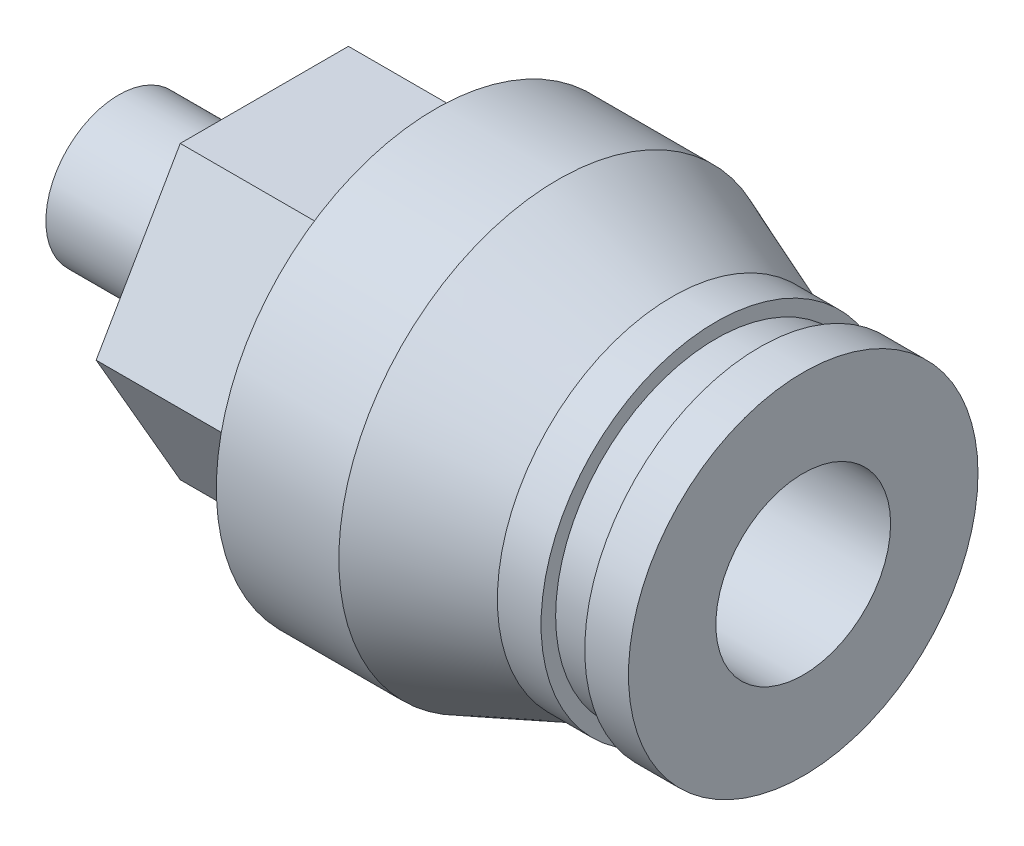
ISO-10303-21;
HEADER;
FILE_DESCRIPTION(('STEP AP214'),'2;1');
FILE_NAME('part.step','',(''),(''),'','','');
FILE_SCHEMA(('AUTOMOTIVE_DESIGN { 1 0 10303 214 1 1 1 1 }'));
ENDSEC;
DATA;
#1=APPLICATION_CONTEXT('core data for automotive mechanical design processes');
#2=APPLICATION_PROTOCOL_DEFINITION('international standard','automotive_design',2000,#1);
#3=PRODUCT_CONTEXT('',#1,'mechanical');
#4=PRODUCT('Part','Part','',(#3));
#5=PRODUCT_RELATED_PRODUCT_CATEGORY('part','',(#4));
#6=PRODUCT_DEFINITION_FORMATION('','',#4);
#7=PRODUCT_DEFINITION_CONTEXT('part definition',#1,'design');
#8=PRODUCT_DEFINITION('design','',#6,#7);
#9=PRODUCT_DEFINITION_SHAPE('','',#8);
#10=(LENGTH_UNIT() NAMED_UNIT(*) SI_UNIT(.MILLI.,.METRE.));
#11=(NAMED_UNIT(*) PLANE_ANGLE_UNIT() SI_UNIT($,.RADIAN.));
#12=(NAMED_UNIT(*) SI_UNIT($,.STERADIAN.) SOLID_ANGLE_UNIT());
#13=UNCERTAINTY_MEASURE_WITH_UNIT(LENGTH_MEASURE(1.E-05),#10,'distance_accuracy_value','');
#14=(GEOMETRIC_REPRESENTATION_CONTEXT(3) GLOBAL_UNCERTAINTY_ASSIGNED_CONTEXT((#13)) GLOBAL_UNIT_ASSIGNED_CONTEXT((#10,
#11,#12)) REPRESENTATION_CONTEXT('',''));
#15=CARTESIAN_POINT('',(0.,0.,0.));
#16=DIRECTION('',(0.,0.,1.));
#17=DIRECTION('',(1.,0.,0.));
#18=AXIS2_PLACEMENT_3D('',#15,#16,#17);
#19=CARTESIAN_POINT('',(5.,2.5,0.));
#20=DIRECTION('',(-1.,0.,0.));
#21=DIRECTION('',(0.,0.,1.));
#22=AXIS2_PLACEMENT_3D('',#19,#20,#21);
#23=PLANE('',#22);
#24=CARTESIAN_POINT('',(5.,0.,0.));
#25=DIRECTION('',(1.,0.,0.));
#26=DIRECTION('',(0.,0.,-1.));
#27=AXIS2_PLACEMENT_3D('',#24,#25,#26);
#28=CIRCLE('',#27,2.5);
#29=CARTESIAN_POINT('',(5.,0.,-2.5));
#30=VERTEX_POINT('',#29);
#31=EDGE_CURVE('E218',#30,#30,#28,.T.);
#32=ORIENTED_EDGE('',*,*,#31,.T.);
#33=EDGE_LOOP('',(#32));
#34=FACE_BOUND('',#33,.T.);
#35=DIRECTION('',(0.,-0.866025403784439,0.5));
#36=VECTOR('',#35,1.);
#37=CARTESIAN_POINT('',(5.,0.,-5.77350269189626));
#38=LINE('',#37,#36);
#39=CARTESIAN_POINT('',(5.,0.,-5.77350269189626));
#40=VERTEX_POINT('',#39);
#41=CARTESIAN_POINT('',(5.,-5.,-2.88675134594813));
#42=VERTEX_POINT('',#41);
#43=EDGE_CURVE('E127',#40,#42,#38,.T.);
#44=ORIENTED_EDGE('',*,*,#43,.T.);
#45=DIRECTION('',(0.,0.,1.));
#46=VECTOR('',#45,1.);
#47=CARTESIAN_POINT('',(5.,-5.,-2.88675134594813));
#48=LINE('',#47,#46);
#49=CARTESIAN_POINT('',(5.,-5.,2.88675134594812));
#50=VERTEX_POINT('',#49);
#51=EDGE_CURVE('E110',#42,#50,#48,.T.);
#52=ORIENTED_EDGE('',*,*,#51,.T.);
#53=DIRECTION('',(0.,0.866025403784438,0.5));
#54=VECTOR('',#53,1.);
#55=CARTESIAN_POINT('',(5.,-5.,2.88675134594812));
#56=LINE('',#55,#54);
#57=CARTESIAN_POINT('',(5.,0.,5.77350269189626));
#58=VERTEX_POINT('',#57);
#59=EDGE_CURVE('E121',#50,#58,#56,.T.);
#60=ORIENTED_EDGE('',*,*,#59,.T.);
#61=DIRECTION('',(0.,0.866025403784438,-0.5));
#62=VECTOR('',#61,1.);
#63=CARTESIAN_POINT('',(5.,0.,5.77350269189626));
#64=LINE('',#63,#62);
#65=CARTESIAN_POINT('',(5.,5.,2.88675134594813));
#66=VERTEX_POINT('',#65);
#67=EDGE_CURVE('E30',#58,#66,#64,.T.);
#68=ORIENTED_EDGE('',*,*,#67,.T.);
#69=DIRECTION('',(0.,0.,-1.));
#70=VECTOR('',#69,1.);
#71=CARTESIAN_POINT('',(5.,5.,2.88675134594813));
#72=LINE('',#71,#70);
#73=CARTESIAN_POINT('',(5.,5.,-2.88675134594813));
#74=VERTEX_POINT('',#73);
#75=EDGE_CURVE('E131',#66,#74,#72,.T.);
#76=ORIENTED_EDGE('',*,*,#75,.T.);
#77=DIRECTION('',(0.,-0.866025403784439,-0.5));
#78=VECTOR('',#77,1.);
#79=CARTESIAN_POINT('',(5.,5.,-2.88675134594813));
#80=LINE('',#79,#78);
#81=EDGE_CURVE('E134',#74,#40,#80,.T.);
#82=ORIENTED_EDGE('',*,*,#81,.T.);
#83=EDGE_LOOP('',(#44,#52,#60,#68,#76,#82));
#84=FACE_BOUND('',#83,.T.);
#85=ADVANCED_FACE('F15',(#34,#84),#23,.T.);
#86=CARTESIAN_POINT('',(0.,0.,0.));
#87=DIRECTION('',(-1.,0.,0.));
#88=DIRECTION('',(0.,0.,1.));
#89=AXIS2_PLACEMENT_3D('',#86,#87,#88);
#90=PLANE('',#89);
#91=CARTESIAN_POINT('',(0.,0.,0.));
#92=DIRECTION('',(1.,0.,0.));
#93=DIRECTION('',(0.,0.,-1.));
#94=AXIS2_PLACEMENT_3D('',#91,#92,#93);
#95=CIRCLE('',#94,2.5);
#96=CARTESIAN_POINT('',(0.,0.,-2.5));
#97=VERTEX_POINT('',#96);
#98=EDGE_CURVE('E221',#97,#97,#95,.T.);
#99=ORIENTED_EDGE('',*,*,#98,.F.);
#100=EDGE_LOOP('',(#99));
#101=FACE_BOUND('',#100,.T.);
#102=DIRECTION('',(0.,-0.866025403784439,-0.5));
#103=VECTOR('',#102,1.);
#104=CARTESIAN_POINT('',(0.,0.,1.15470053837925));
#105=LINE('',#104,#103);
#106=CARTESIAN_POINT('',(0.,0.,1.15470053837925));
#107=VERTEX_POINT('',#106);
#108=CARTESIAN_POINT('',(0.,-1.,0.577350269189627));
#109=VERTEX_POINT('',#108);
#110=EDGE_CURVE('E173',#107,#109,#105,.T.);
#111=ORIENTED_EDGE('',*,*,#110,.T.);
#112=DIRECTION('',(0.,0.,-1.));
#113=VECTOR('',#112,1.);
#114=CARTESIAN_POINT('',(0.,-1.,0.577350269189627));
#115=LINE('',#114,#113);
#116=CARTESIAN_POINT('',(0.,-1.,-0.577350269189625));
#117=VERTEX_POINT('',#116);
#118=EDGE_CURVE('E38',#109,#117,#115,.T.);
#119=ORIENTED_EDGE('',*,*,#118,.T.);
#120=DIRECTION('',(0.,0.866025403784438,-0.5));
#121=VECTOR('',#120,1.);
#122=CARTESIAN_POINT('',(0.,-1.,-0.577350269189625));
#123=LINE('',#122,#121);
#124=CARTESIAN_POINT('',(0.,0.,-1.15470053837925));
#125=VERTEX_POINT('',#124);
#126=EDGE_CURVE('E161',#117,#125,#123,.T.);
#127=ORIENTED_EDGE('',*,*,#126,.T.);
#128=DIRECTION('',(0.,0.866025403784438,0.5));
#129=VECTOR('',#128,1.);
#130=CARTESIAN_POINT('',(0.,0.,-1.15470053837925));
#131=LINE('',#130,#129);
#132=CARTESIAN_POINT('',(0.,1.,-0.577350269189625));
#133=VERTEX_POINT('',#132);
#134=EDGE_CURVE('E164',#125,#133,#131,.T.);
#135=ORIENTED_EDGE('',*,*,#134,.T.);
#136=DIRECTION('',(0.,0.,1.));
#137=VECTOR('',#136,1.);
#138=CARTESIAN_POINT('',(0.,1.,-0.577350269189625));
#139=LINE('',#138,#137);
#140=CARTESIAN_POINT('',(0.,1.,0.577350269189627));
#141=VERTEX_POINT('',#140);
#142=EDGE_CURVE('E167',#133,#141,#139,.T.);
#143=ORIENTED_EDGE('',*,*,#142,.T.);
#144=DIRECTION('',(0.,-0.866025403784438,0.5));
#145=VECTOR('',#144,1.);
#146=CARTESIAN_POINT('',(0.,1.,0.577350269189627));
#147=LINE('',#146,#145);
#148=EDGE_CURVE('E170',#141,#107,#147,.T.);
#149=ORIENTED_EDGE('',*,*,#148,.T.);
#150=EDGE_LOOP('',(#111,#119,#127,#135,#143,#149));
#151=FACE_BOUND('',#150,.T.);
#152=ADVANCED_FACE('F17',(#101,#151),#90,.T.);
#153=CARTESIAN_POINT('',(7.,3.,0.));
#154=DIRECTION('',(1.,0.,0.));
#155=DIRECTION('',(0.,0.,-1.));
#156=AXIS2_PLACEMENT_3D('',#153,#154,#155);
#157=PLANE('',#156);
#158=CARTESIAN_POINT('',(7.,0.,0.));
#159=DIRECTION('',(1.,0.,0.));
#160=DIRECTION('',(0.,0.,-1.));
#161=AXIS2_PLACEMENT_3D('',#158,#159,#160);
#162=CIRCLE('',#161,3.);
#163=CARTESIAN_POINT('',(7.,0.,-3.));
#164=VERTEX_POINT('',#163);
#165=EDGE_CURVE('E188',#164,#164,#162,.T.);
#166=ORIENTED_EDGE('',*,*,#165,.T.);
#167=EDGE_LOOP('',(#166));
#168=FACE_BOUND('',#167,.T.);
#169=DIRECTION('',(0.,-0.866025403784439,0.5));
#170=VECTOR('',#169,1.);
#171=CARTESIAN_POINT('',(7.,1.75,-2.1650635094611));
#172=LINE('',#171,#170);
#173=CARTESIAN_POINT('',(7.,0.,-1.15470053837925));
#174=VERTEX_POINT('',#173);
#175=CARTESIAN_POINT('',(7.,-1.,-0.577350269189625));
#176=VERTEX_POINT('',#175);
#177=EDGE_CURVE('E23',#174,#176,#172,.T.);
#178=ORIENTED_EDGE('',*,*,#177,.T.);
#179=DIRECTION('',(0.,0.,1.));
#180=VECTOR('',#179,1.);
#181=CARTESIAN_POINT('',(7.,-1.,0.));
#182=LINE('',#181,#180);
#183=CARTESIAN_POINT('',(7.,-1.,0.577350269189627));
#184=VERTEX_POINT('',#183);
#185=EDGE_CURVE('E9',#176,#184,#182,.T.);
#186=ORIENTED_EDGE('',*,*,#185,.T.);
#187=DIRECTION('',(0.,0.866025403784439,0.5));
#188=VECTOR('',#187,1.);
#189=CARTESIAN_POINT('',(7.,1.75,2.1650635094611));
#190=LINE('',#189,#188);
#191=CARTESIAN_POINT('',(7.,0.,1.15470053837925));
#192=VERTEX_POINT('',#191);
#193=EDGE_CURVE('E224',#184,#192,#190,.T.);
#194=ORIENTED_EDGE('',*,*,#193,.T.);
#195=DIRECTION('',(0.,0.866025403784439,-0.5));
#196=VECTOR('',#195,1.);
#197=CARTESIAN_POINT('',(7.,2.75,-0.433012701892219));
#198=LINE('',#197,#196);
#199=CARTESIAN_POINT('',(7.,1.,0.577350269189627));
#200=VERTEX_POINT('',#199);
#201=EDGE_CURVE('E227',#192,#200,#198,.T.);
#202=ORIENTED_EDGE('',*,*,#201,.T.);
#203=DIRECTION('',(0.,0.,-1.));
#204=VECTOR('',#203,1.);
#205=CARTESIAN_POINT('',(7.,1.,0.));
#206=LINE('',#205,#204);
#207=CARTESIAN_POINT('',(7.,1.,-0.577350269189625));
#208=VERTEX_POINT('',#207);
#209=EDGE_CURVE('E230',#200,#208,#206,.T.);
#210=ORIENTED_EDGE('',*,*,#209,.T.);
#211=DIRECTION('',(0.,-0.866025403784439,-0.5));
#212=VECTOR('',#211,1.);
#213=CARTESIAN_POINT('',(7.,2.75,0.433012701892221));
#214=LINE('',#213,#212);
#215=EDGE_CURVE('E233',#208,#174,#214,.T.);
#216=ORIENTED_EDGE('',*,*,#215,.T.);
#217=EDGE_LOOP('',(#178,#186,#194,#202,#210,#216));
#218=FACE_BOUND('',#217,.T.);
#219=ADVANCED_FACE('F237',(#168,#218),#157,.T.);
#220=CARTESIAN_POINT('',(0.,0.,0.));
#221=DIRECTION('',(1.,0.,0.));
#222=DIRECTION('',(0.,0.,-1.));
#223=AXIS2_PLACEMENT_3D('',#220,#221,#222);
#224=CYLINDRICAL_SURFACE('',#223,2.5);
#225=ORIENTED_EDGE('',*,*,#98,.T.);
#226=EDGE_LOOP('',(#225));
#227=FACE_BOUND('',#226,.T.);
#228=ORIENTED_EDGE('',*,*,#31,.F.);
#229=EDGE_LOOP('',(#228));
#230=FACE_BOUND('',#229,.T.);
#231=ADVANCED_FACE('F278',(#227,#230),#224,.T.);
#232=CARTESIAN_POINT('',(10.875,7.,0.));
#233=DIRECTION('',(-1.,0.,0.));
#234=DIRECTION('',(0.,0.,1.));
#235=AXIS2_PLACEMENT_3D('',#232,#233,#234);
#236=PLANE('',#235);
#237=CARTESIAN_POINT('',(10.875,0.,0.));
#238=DIRECTION('',(1.,0.,0.));
#239=DIRECTION('',(0.,0.,-1.));
#240=AXIS2_PLACEMENT_3D('',#237,#238,#239);
#241=CIRCLE('',#240,7.52263029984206);
#242=CARTESIAN_POINT('',(10.875,0.,-7.52263029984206));
#243=VERTEX_POINT('',#242);
#244=EDGE_CURVE('E215',#243,#243,#241,.T.);
#245=ORIENTED_EDGE('',*,*,#244,.F.);
#246=EDGE_LOOP('',(#245));
#247=FACE_BOUND('',#246,.T.);
#248=DIRECTION('',(0.,-0.866025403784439,0.5));
#249=VECTOR('',#248,1.);
#250=CARTESIAN_POINT('',(10.875,0.,-5.77350269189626));
#251=LINE('',#250,#249);
#252=CARTESIAN_POINT('',(10.875,0.,-5.77350269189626));
#253=VERTEX_POINT('',#252);
#254=CARTESIAN_POINT('',(10.875,-5.,-2.88675134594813));
#255=VERTEX_POINT('',#254);
#256=EDGE_CURVE('E118',#253,#255,#251,.T.);
#257=ORIENTED_EDGE('',*,*,#256,.F.);
#258=DIRECTION('',(0.,-0.866025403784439,-0.5));
#259=VECTOR('',#258,1.);
#260=CARTESIAN_POINT('',(10.875,5.,-2.88675134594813));
#261=LINE('',#260,#259);
#262=CARTESIAN_POINT('',(10.875,5.,-2.88675134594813));
#263=VERTEX_POINT('',#262);
#264=EDGE_CURVE('E146',#263,#253,#261,.T.);
#265=ORIENTED_EDGE('',*,*,#264,.F.);
#266=DIRECTION('',(0.,0.,-1.));
#267=VECTOR('',#266,1.);
#268=CARTESIAN_POINT('',(10.875,5.,2.88675134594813));
#269=LINE('',#268,#267);
#270=CARTESIAN_POINT('',(10.875,5.,2.88675134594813));
#271=VERTEX_POINT('',#270);
#272=EDGE_CURVE('E143',#271,#263,#269,.T.);
#273=ORIENTED_EDGE('',*,*,#272,.F.);
#274=DIRECTION('',(0.,0.866025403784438,-0.5));
#275=VECTOR('',#274,1.);
#276=CARTESIAN_POINT('',(10.875,0.,5.77350269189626));
#277=LINE('',#276,#275);
#278=CARTESIAN_POINT('',(10.875,0.,5.77350269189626));
#279=VERTEX_POINT('',#278);
#280=EDGE_CURVE('E140',#279,#271,#277,.T.);
#281=ORIENTED_EDGE('',*,*,#280,.F.);
#282=DIRECTION('',(0.,0.866025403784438,0.5));
#283=VECTOR('',#282,1.);
#284=CARTESIAN_POINT('',(10.875,-5.,2.88675134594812));
#285=LINE('',#284,#283);
#286=CARTESIAN_POINT('',(10.875,-5.,2.88675134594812));
#287=VERTEX_POINT('',#286);
#288=EDGE_CURVE('E138',#287,#279,#285,.T.);
#289=ORIENTED_EDGE('',*,*,#288,.F.);
#290=DIRECTION('',(0.,0.,1.));
#291=VECTOR('',#290,1.);
#292=CARTESIAN_POINT('',(10.875,-5.,-2.88675134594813));
#293=LINE('',#292,#291);
#294=EDGE_CURVE('E113',#255,#287,#293,.T.);
#295=ORIENTED_EDGE('',*,*,#294,.F.);
#296=EDGE_LOOP('',(#257,#265,#273,#281,#289,#295));
#297=FACE_BOUND('',#296,.T.);
#298=ADVANCED_FACE('F276',(#247,#297),#236,.T.);
#299=CARTESIAN_POINT('',(0.,0.,0.));
#300=DIRECTION('',(1.,0.,0.));
#301=DIRECTION('',(0.,0.,-1.));
#302=AXIS2_PLACEMENT_3D('',#299,#300,#301);
#303=CYLINDRICAL_SURFACE('',#302,7.52263029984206);
#304=ORIENTED_EDGE('',*,*,#244,.T.);
#305=EDGE_LOOP('',(#304));
#306=FACE_BOUND('',#305,.T.);
#307=CARTESIAN_POINT('',(15.0801709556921,0.,0.));
#308=DIRECTION('',(1.,0.,0.));
#309=DIRECTION('',(0.,0.,-1.));
#310=AXIS2_PLACEMENT_3D('',#307,#308,#309);
#311=CIRCLE('',#310,7.52263029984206);
#312=CARTESIAN_POINT('',(15.0801709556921,0.,-7.52263029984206));
#313=VERTEX_POINT('',#312);
#314=EDGE_CURVE('E212',#313,#313,#311,.T.);
#315=ORIENTED_EDGE('',*,*,#314,.F.);
#316=EDGE_LOOP('',(#315));
#317=FACE_BOUND('',#316,.T.);
#318=ADVANCED_FACE('F285',(#306,#317),#303,.T.);
#319=CARTESIAN_POINT('',(19.,0.,0.));
#320=DIRECTION('',(-1.,0.,0.));
#321=DIRECTION('',(0.,0.,1.));
#322=AXIS2_PLACEMENT_3D('',#319,#320,#321);
#323=CONICAL_SURFACE('',#322,6.,0.37050394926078);
#324=ORIENTED_EDGE('',*,*,#314,.T.);
#325=EDGE_LOOP('',(#324));
#326=FACE_BOUND('',#325,.T.);
#327=CARTESIAN_POINT('',(19.,0.,0.));
#328=DIRECTION('',(1.,0.,0.));
#329=DIRECTION('',(0.,0.,-1.));
#330=AXIS2_PLACEMENT_3D('',#327,#328,#329);
#331=CIRCLE('',#330,6.);
#332=CARTESIAN_POINT('',(19.,0.,-6.));
#333=VERTEX_POINT('',#332);
#334=EDGE_CURVE('E209',#333,#333,#331,.T.);
#335=ORIENTED_EDGE('',*,*,#334,.F.);
#336=EDGE_LOOP('',(#335));
#337=FACE_BOUND('',#336,.T.);
#338=ADVANCED_FACE('F316',(#326,#337),#323,.T.);
#339=CARTESIAN_POINT('',(0.,0.,0.));
#340=DIRECTION('',(1.,0.,0.));
#341=DIRECTION('',(0.,0.,-1.));
#342=AXIS2_PLACEMENT_3D('',#339,#340,#341);
#343=CYLINDRICAL_SURFACE('',#342,6.);
#344=ORIENTED_EDGE('',*,*,#334,.T.);
#345=EDGE_LOOP('',(#344));
#346=FACE_BOUND('',#345,.T.);
#347=CARTESIAN_POINT('',(20.5,0.,0.));
#348=DIRECTION('',(1.,0.,0.));
#349=DIRECTION('',(0.,0.,-1.));
#350=AXIS2_PLACEMENT_3D('',#347,#348,#349);
#351=CIRCLE('',#350,6.);
#352=CARTESIAN_POINT('',(20.5,0.,-6.));
#353=VERTEX_POINT('',#352);
#354=EDGE_CURVE('E206',#353,#353,#351,.T.);
#355=ORIENTED_EDGE('',*,*,#354,.F.);
#356=EDGE_LOOP('',(#355));
#357=FACE_BOUND('',#356,.T.);
#358=ADVANCED_FACE('F312',(#346,#357),#343,.T.);
#359=CARTESIAN_POINT('',(20.5,6.,0.));
#360=DIRECTION('',(1.,0.,0.));
#361=DIRECTION('',(0.,0.,-1.));
#362=AXIS2_PLACEMENT_3D('',#359,#360,#361);
#363=PLANE('',#362);
#364=ORIENTED_EDGE('',*,*,#354,.T.);
#365=EDGE_LOOP('',(#364));
#366=FACE_BOUND('',#365,.T.);
#367=CARTESIAN_POINT('',(20.5,0.,0.));
#368=DIRECTION('',(1.,0.,0.));
#369=DIRECTION('',(0.,0.,-1.));
#370=AXIS2_PLACEMENT_3D('',#367,#368,#369);
#371=CIRCLE('',#370,5.5);
#372=CARTESIAN_POINT('',(20.5,0.,-5.5));
#373=VERTEX_POINT('',#372);
#374=EDGE_CURVE('E203',#373,#373,#371,.T.);
#375=ORIENTED_EDGE('',*,*,#374,.F.);
#376=EDGE_LOOP('',(#375));
#377=FACE_BOUND('',#376,.T.);
#378=ADVANCED_FACE('F308',(#366,#377),#363,.T.);
#379=CARTESIAN_POINT('',(0.,0.,0.));
#380=DIRECTION('',(1.,0.,0.));
#381=DIRECTION('',(0.,0.,-1.));
#382=AXIS2_PLACEMENT_3D('',#379,#380,#381);
#383=CYLINDRICAL_SURFACE('',#382,5.5);
#384=ORIENTED_EDGE('',*,*,#374,.T.);
#385=EDGE_LOOP('',(#384));
#386=FACE_BOUND('',#385,.T.);
#387=CARTESIAN_POINT('',(22.,0.,0.));
#388=DIRECTION('',(1.,0.,0.));
#389=DIRECTION('',(0.,0.,-1.));
#390=AXIS2_PLACEMENT_3D('',#387,#388,#389);
#391=CIRCLE('',#390,5.5);
#392=CARTESIAN_POINT('',(22.,0.,-5.5));
#393=VERTEX_POINT('',#392);
#394=EDGE_CURVE('E200',#393,#393,#391,.T.);
#395=ORIENTED_EDGE('',*,*,#394,.F.);
#396=EDGE_LOOP('',(#395));
#397=FACE_BOUND('',#396,.T.);
#398=ADVANCED_FACE('F304',(#386,#397),#383,.T.);
#399=CARTESIAN_POINT('',(22.,5.5,0.));
#400=DIRECTION('',(-1.,0.,0.));
#401=DIRECTION('',(0.,0.,1.));
#402=AXIS2_PLACEMENT_3D('',#399,#400,#401);
#403=PLANE('',#402);
#404=ORIENTED_EDGE('',*,*,#394,.T.);
#405=EDGE_LOOP('',(#404));
#406=FACE_BOUND('',#405,.T.);
#407=CARTESIAN_POINT('',(22.,0.,0.));
#408=DIRECTION('',(1.,0.,0.));
#409=DIRECTION('',(0.,0.,-1.));
#410=AXIS2_PLACEMENT_3D('',#407,#408,#409);
#411=CIRCLE('',#410,6.);
#412=CARTESIAN_POINT('',(22.,0.,-6.));
#413=VERTEX_POINT('',#412);
#414=EDGE_CURVE('E197',#413,#413,#411,.T.);
#415=ORIENTED_EDGE('',*,*,#414,.F.);
#416=EDGE_LOOP('',(#415));
#417=FACE_BOUND('',#416,.T.);
#418=ADVANCED_FACE('F300',(#406,#417),#403,.T.);
#419=CARTESIAN_POINT('',(0.,0.,0.));
#420=DIRECTION('',(1.,0.,0.));
#421=DIRECTION('',(0.,0.,-1.));
#422=AXIS2_PLACEMENT_3D('',#419,#420,#421);
#423=CYLINDRICAL_SURFACE('',#422,6.);
#424=ORIENTED_EDGE('',*,*,#414,.T.);
#425=EDGE_LOOP('',(#424));
#426=FACE_BOUND('',#425,.T.);
#427=CARTESIAN_POINT('',(23.5,0.,0.));
#428=DIRECTION('',(1.,0.,0.));
#429=DIRECTION('',(0.,0.,-1.));
#430=AXIS2_PLACEMENT_3D('',#427,#428,#429);
#431=CIRCLE('',#430,6.);
#432=CARTESIAN_POINT('',(23.5,0.,-6.));
#433=VERTEX_POINT('',#432);
#434=EDGE_CURVE('E194',#433,#433,#431,.T.);
#435=ORIENTED_EDGE('',*,*,#434,.F.);
#436=EDGE_LOOP('',(#435));
#437=FACE_BOUND('',#436,.T.);
#438=ADVANCED_FACE('F296',(#426,#437),#423,.T.);
#439=CARTESIAN_POINT('',(23.5,6.,0.));
#440=DIRECTION('',(1.,0.,0.));
#441=DIRECTION('',(0.,0.,-1.));
#442=AXIS2_PLACEMENT_3D('',#439,#440,#441);
#443=PLANE('',#442);
#444=ORIENTED_EDGE('',*,*,#434,.T.);
#445=EDGE_LOOP('',(#444));
#446=FACE_BOUND('',#445,.T.);
#447=CARTESIAN_POINT('',(23.5,0.,0.));
#448=DIRECTION('',(1.,0.,0.));
#449=DIRECTION('',(0.,0.,-1.));
#450=AXIS2_PLACEMENT_3D('',#447,#448,#449);
#451=CIRCLE('',#450,3.);
#452=CARTESIAN_POINT('',(23.5,0.,-3.));
#453=VERTEX_POINT('',#452);
#454=EDGE_CURVE('E191',#453,#453,#451,.T.);
#455=ORIENTED_EDGE('',*,*,#454,.F.);
#456=EDGE_LOOP('',(#455));
#457=FACE_BOUND('',#456,.T.);
#458=ADVANCED_FACE('F264',(#446,#457),#443,.T.);
#459=CARTESIAN_POINT('',(0.,0.,0.));
#460=DIRECTION('',(1.,0.,0.));
#461=DIRECTION('',(0.,0.,-1.));
#462=AXIS2_PLACEMENT_3D('',#459,#460,#461);
#463=CYLINDRICAL_SURFACE('',#462,3.);
#464=ORIENTED_EDGE('',*,*,#454,.T.);
#465=EDGE_LOOP('',(#464));
#466=FACE_BOUND('',#465,.T.);
#467=ORIENTED_EDGE('',*,*,#165,.F.);
#468=EDGE_LOOP('',(#467));
#469=FACE_BOUND('',#468,.T.);
#470=ADVANCED_FACE('F256',(#466,#469),#463,.F.);
#471=CARTESIAN_POINT('',(23.5,-1.,0.577350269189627));
#472=DIRECTION('',(0.,1.,0.));
#473=DIRECTION('',(0.,0.,1.));
#474=AXIS2_PLACEMENT_3D('',#471,#472,#473);
#475=PLANE('',#474);
#476=DIRECTION('',(-1.,0.,0.));
#477=VECTOR('',#476,1.);
#478=CARTESIAN_POINT('',(23.5,-1.,-0.577350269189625));
#479=LINE('',#478,#477);
#480=EDGE_CURVE('E186',#176,#117,#479,.T.);
#481=ORIENTED_EDGE('',*,*,#480,.T.);
#482=ORIENTED_EDGE('',*,*,#118,.F.);
#483=DIRECTION('',(-1.,0.,0.));
#484=VECTOR('',#483,1.);
#485=CARTESIAN_POINT('',(23.5,-1.,0.577350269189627));
#486=LINE('',#485,#484);
#487=EDGE_CURVE('E176',#184,#109,#486,.T.);
#488=ORIENTED_EDGE('',*,*,#487,.F.);
#489=ORIENTED_EDGE('',*,*,#185,.F.);
#490=EDGE_LOOP('',(#481,#482,#488,#489));
#491=FACE_BOUND('',#490,.T.);
#492=ADVANCED_FACE('F254',(#491),#475,.T.);
#493=CARTESIAN_POINT('',(23.5,-1.,-0.577350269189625));
#494=DIRECTION('',(0.,0.5,0.866025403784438));
#495=DIRECTION('',(0.,-0.866025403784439,0.5));
#496=AXIS2_PLACEMENT_3D('',#493,#494,#495);
#497=PLANE('',#496);
#498=DIRECTION('',(-1.,0.,0.));
#499=VECTOR('',#498,1.);
#500=CARTESIAN_POINT('',(23.5,0.,-1.15470053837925));
#501=LINE('',#500,#499);
#502=EDGE_CURVE('E184',#174,#125,#501,.T.);
#503=ORIENTED_EDGE('',*,*,#502,.T.);
#504=ORIENTED_EDGE('',*,*,#126,.F.);
#505=ORIENTED_EDGE('',*,*,#480,.F.);
#506=ORIENTED_EDGE('',*,*,#177,.F.);
#507=EDGE_LOOP('',(#503,#504,#505,#506));
#508=FACE_BOUND('',#507,.T.);
#509=ADVANCED_FACE('F241',(#508),#497,.T.);
#510=CARTESIAN_POINT('',(23.5,0.,-1.15470053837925));
#511=DIRECTION('',(0.,-0.5,0.866025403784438));
#512=DIRECTION('',(0.,-0.866025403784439,-0.5));
#513=AXIS2_PLACEMENT_3D('',#510,#511,#512);
#514=PLANE('',#513);
#515=DIRECTION('',(-1.,0.,0.));
#516=VECTOR('',#515,1.);
#517=CARTESIAN_POINT('',(23.5,1.,-0.577350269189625));
#518=LINE('',#517,#516);
#519=EDGE_CURVE('E182',#208,#133,#518,.T.);
#520=ORIENTED_EDGE('',*,*,#519,.T.);
#521=ORIENTED_EDGE('',*,*,#134,.F.);
#522=ORIENTED_EDGE('',*,*,#502,.F.);
#523=ORIENTED_EDGE('',*,*,#215,.F.);
#524=EDGE_LOOP('',(#520,#521,#522,#523));
#525=FACE_BOUND('',#524,.T.);
#526=ADVANCED_FACE('F245',(#525),#514,.T.);
#527=CARTESIAN_POINT('',(23.5,1.,-0.577350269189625));
#528=DIRECTION('',(0.,-1.,0.));
#529=DIRECTION('',(0.,0.,-1.));
#530=AXIS2_PLACEMENT_3D('',#527,#528,#529);
#531=PLANE('',#530);
#532=DIRECTION('',(-1.,0.,0.));
#533=VECTOR('',#532,1.);
#534=CARTESIAN_POINT('',(23.5,1.,0.577350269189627));
#535=LINE('',#534,#533);
#536=EDGE_CURVE('E180',#200,#141,#535,.T.);
#537=ORIENTED_EDGE('',*,*,#536,.T.);
#538=ORIENTED_EDGE('',*,*,#142,.F.);
#539=ORIENTED_EDGE('',*,*,#519,.F.);
#540=ORIENTED_EDGE('',*,*,#209,.F.);
#541=EDGE_LOOP('',(#537,#538,#539,#540));
#542=FACE_BOUND('',#541,.T.);
#543=ADVANCED_FACE('F373',(#542),#531,.T.);
#544=CARTESIAN_POINT('',(23.5,1.,0.577350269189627));
#545=DIRECTION('',(0.,-0.5,-0.866025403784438));
#546=DIRECTION('',(0.,0.866025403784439,-0.5));
#547=AXIS2_PLACEMENT_3D('',#544,#545,#546);
#548=PLANE('',#547);
#549=DIRECTION('',(-1.,0.,0.));
#550=VECTOR('',#549,1.);
#551=CARTESIAN_POINT('',(23.5,0.,1.15470053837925));
#552=LINE('',#551,#550);
#553=EDGE_CURVE('E178',#192,#107,#552,.T.);
#554=ORIENTED_EDGE('',*,*,#553,.T.);
#555=ORIENTED_EDGE('',*,*,#148,.F.);
#556=ORIENTED_EDGE('',*,*,#536,.F.);
#557=ORIENTED_EDGE('',*,*,#201,.F.);
#558=EDGE_LOOP('',(#554,#555,#556,#557));
#559=FACE_BOUND('',#558,.T.);
#560=ADVANCED_FACE('F370',(#559),#548,.T.);
#561=CARTESIAN_POINT('',(23.5,0.,1.15470053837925));
#562=DIRECTION('',(0.,0.5,-0.866025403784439));
#563=DIRECTION('',(0.,0.866025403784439,0.5));
#564=AXIS2_PLACEMENT_3D('',#561,#562,#563);
#565=PLANE('',#564);
#566=ORIENTED_EDGE('',*,*,#487,.T.);
#567=ORIENTED_EDGE('',*,*,#110,.F.);
#568=ORIENTED_EDGE('',*,*,#553,.F.);
#569=ORIENTED_EDGE('',*,*,#193,.F.);
#570=EDGE_LOOP('',(#566,#567,#568,#569));
#571=FACE_BOUND('',#570,.T.);
#572=ADVANCED_FACE('F252',(#571),#565,.T.);
#573=CARTESIAN_POINT('',(10.875,-5.,-2.88675134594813));
#574=DIRECTION('',(0.,-1.,0.));
#575=DIRECTION('',(0.,0.,-1.));
#576=AXIS2_PLACEMENT_3D('',#573,#574,#575);
#577=PLANE('',#576);
#578=DIRECTION('',(-1.,0.,0.));
#579=VECTOR('',#578,1.);
#580=CARTESIAN_POINT('',(10.875,-5.,-2.88675134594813));
#581=LINE('',#580,#579);
#582=EDGE_CURVE('E151',#255,#42,#581,.T.);
#583=ORIENTED_EDGE('',*,*,#582,.F.);
#584=ORIENTED_EDGE('',*,*,#294,.T.);
#585=DIRECTION('',(-1.,0.,0.));
#586=VECTOR('',#585,1.);
#587=CARTESIAN_POINT('',(10.875,-5.,2.88675134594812));
#588=LINE('',#587,#586);
#589=EDGE_CURVE('E106',#287,#50,#588,.T.);
#590=ORIENTED_EDGE('',*,*,#589,.T.);
#591=ORIENTED_EDGE('',*,*,#51,.F.);
#592=EDGE_LOOP('',(#583,#584,#590,#591));
#593=FACE_BOUND('',#592,.T.);
#594=ADVANCED_FACE('F108',(#593),#577,.T.);
#595=CARTESIAN_POINT('',(10.875,0.,-5.77350269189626));
#596=DIRECTION('',(0.,-0.5,-0.866025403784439));
#597=DIRECTION('',(0.,0.866025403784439,-0.5));
#598=AXIS2_PLACEMENT_3D('',#595,#596,#597);
#599=PLANE('',#598);
#600=DIRECTION('',(-1.,0.,0.));
#601=VECTOR('',#600,1.);
#602=CARTESIAN_POINT('',(10.875,0.,-5.77350269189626));
#603=LINE('',#602,#601);
#604=EDGE_CURVE('E153',#253,#40,#603,.T.);
#605=ORIENTED_EDGE('',*,*,#604,.F.);
#606=ORIENTED_EDGE('',*,*,#256,.T.);
#607=ORIENTED_EDGE('',*,*,#582,.T.);
#608=ORIENTED_EDGE('',*,*,#43,.F.);
#609=EDGE_LOOP('',(#605,#606,#607,#608));
#610=FACE_BOUND('',#609,.T.);
#611=ADVANCED_FACE('F367',(#610),#599,.T.);
#612=CARTESIAN_POINT('',(10.875,5.,-2.88675134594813));
#613=DIRECTION('',(0.,0.5,-0.866025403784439));
#614=DIRECTION('',(0.,0.866025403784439,0.5));
#615=AXIS2_PLACEMENT_3D('',#612,#613,#614);
#616=PLANE('',#615);
#617=DIRECTION('',(-1.,0.,0.));
#618=VECTOR('',#617,1.);
#619=CARTESIAN_POINT('',(10.875,5.,-2.88675134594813));
#620=LINE('',#619,#618);
#621=EDGE_CURVE('E155',#263,#74,#620,.T.);
#622=ORIENTED_EDGE('',*,*,#621,.F.);
#623=ORIENTED_EDGE('',*,*,#264,.T.);
#624=ORIENTED_EDGE('',*,*,#604,.T.);
#625=ORIENTED_EDGE('',*,*,#81,.F.);
#626=EDGE_LOOP('',(#622,#623,#624,#625));
#627=FACE_BOUND('',#626,.T.);
#628=ADVANCED_FACE('F349',(#627),#616,.T.);
#629=CARTESIAN_POINT('',(10.875,5.,2.88675134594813));
#630=DIRECTION('',(0.,1.,0.));
#631=DIRECTION('',(0.,0.,1.));
#632=AXIS2_PLACEMENT_3D('',#629,#630,#631);
#633=PLANE('',#632);
#634=DIRECTION('',(-1.,0.,0.));
#635=VECTOR('',#634,1.);
#636=CARTESIAN_POINT('',(10.875,5.,2.88675134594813));
#637=LINE('',#636,#635);
#638=EDGE_CURVE('E157',#271,#66,#637,.T.);
#639=ORIENTED_EDGE('',*,*,#638,.F.);
#640=ORIENTED_EDGE('',*,*,#272,.T.);
#641=ORIENTED_EDGE('',*,*,#621,.T.);
#642=ORIENTED_EDGE('',*,*,#75,.F.);
#643=EDGE_LOOP('',(#639,#640,#641,#642));
#644=FACE_BOUND('',#643,.T.);
#645=ADVANCED_FACE('F353',(#644),#633,.T.);
#646=CARTESIAN_POINT('',(10.875,0.,5.77350269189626));
#647=DIRECTION('',(0.,0.5,0.866025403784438));
#648=DIRECTION('',(0.,-0.866025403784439,0.5));
#649=AXIS2_PLACEMENT_3D('',#646,#647,#648);
#650=PLANE('',#649);
#651=DIRECTION('',(-1.,0.,0.));
#652=VECTOR('',#651,1.);
#653=CARTESIAN_POINT('',(10.875,0.,5.77350269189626));
#654=LINE('',#653,#652);
#655=EDGE_CURVE('E117',#279,#58,#654,.T.);
#656=ORIENTED_EDGE('',*,*,#655,.F.);
#657=ORIENTED_EDGE('',*,*,#280,.T.);
#658=ORIENTED_EDGE('',*,*,#638,.T.);
#659=ORIENTED_EDGE('',*,*,#67,.F.);
#660=EDGE_LOOP('',(#656,#657,#658,#659));
#661=FACE_BOUND('',#660,.T.);
#662=ADVANCED_FACE('F354',(#661),#650,.T.);
#663=CARTESIAN_POINT('',(10.875,-5.,2.88675134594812));
#664=DIRECTION('',(0.,-0.5,0.866025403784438));
#665=DIRECTION('',(0.,-0.866025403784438,-0.5));
#666=AXIS2_PLACEMENT_3D('',#663,#664,#665);
#667=PLANE('',#666);
#668=ORIENTED_EDGE('',*,*,#589,.F.);
#669=ORIENTED_EDGE('',*,*,#288,.T.);
#670=ORIENTED_EDGE('',*,*,#655,.T.);
#671=ORIENTED_EDGE('',*,*,#59,.F.);
#672=EDGE_LOOP('',(#668,#669,#670,#671));
#673=FACE_BOUND('',#672,.T.);
#674=ADVANCED_FACE('F122',(#673),#667,.T.);
#675=CLOSED_SHELL('',(#85,#152,#219,#231,#298,#318,#338,#358,#378,#398,#418,#438,#458,#470,#492,
#509,#526,#543,#560,#572,#594,#611,#628,#645,#662,#674));
#676=MANIFOLD_SOLID_BREP('B1',#675);
#677=ADVANCED_BREP_SHAPE_REPRESENTATION('',(#18,#676),#14);
#678=SHAPE_DEFINITION_REPRESENTATION(#9,#677);
ENDSEC;
END-ISO-10303-21;
